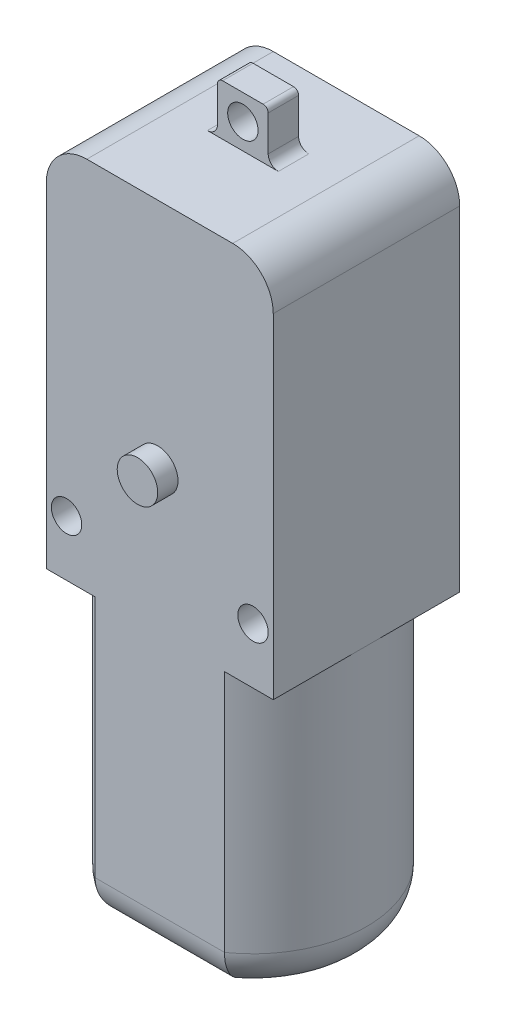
ISO-10303-21;
HEADER;
FILE_DESCRIPTION(('STEP AP214'),'2;1');
FILE_NAME('part.step','',(''),(''),'','','');
FILE_SCHEMA(('AUTOMOTIVE_DESIGN { 1 0 10303 214 1 1 1 1 }'));
ENDSEC;
DATA;
#1=APPLICATION_CONTEXT('core data for automotive mechanical design processes');
#2=APPLICATION_PROTOCOL_DEFINITION('international standard','automotive_design',2000,#1);
#3=PRODUCT_CONTEXT('',#1,'mechanical');
#4=PRODUCT('Part','Part','',(#3));
#5=PRODUCT_RELATED_PRODUCT_CATEGORY('part','',(#4));
#6=PRODUCT_DEFINITION_FORMATION('','',#4);
#7=PRODUCT_DEFINITION_CONTEXT('part definition',#1,'design');
#8=PRODUCT_DEFINITION('design','',#6,#7);
#9=PRODUCT_DEFINITION_SHAPE('','',#8);
#10=(LENGTH_UNIT() NAMED_UNIT(*) SI_UNIT(.MILLI.,.METRE.));
#11=(NAMED_UNIT(*) PLANE_ANGLE_UNIT() SI_UNIT($,.RADIAN.));
#12=(NAMED_UNIT(*) SI_UNIT($,.STERADIAN.) SOLID_ANGLE_UNIT());
#13=UNCERTAINTY_MEASURE_WITH_UNIT(LENGTH_MEASURE(1.E-05),#10,'distance_accuracy_value','');
#14=(GEOMETRIC_REPRESENTATION_CONTEXT(3) GLOBAL_UNCERTAINTY_ASSIGNED_CONTEXT((#13)) GLOBAL_UNIT_ASSIGNED_CONTEXT((#10,
#11,#12)) REPRESENTATION_CONTEXT('',''));
#15=CARTESIAN_POINT('',(0.,0.,0.));
#16=DIRECTION('',(0.,0.,1.));
#17=DIRECTION('',(1.,0.,0.));
#18=AXIS2_PLACEMENT_3D('',#15,#16,#17);
#19=CARTESIAN_POINT('',(4.,37.,18.4));
#20=DIRECTION('',(0.,-1.,0.));
#21=DIRECTION('',(0.,0.,-1.));
#22=AXIS2_PLACEMENT_3D('',#19,#20,#21);
#23=PLANE('',#22);
#24=DIRECTION('',(-1.,0.,0.));
#25=VECTOR('',#24,1.);
#26=CARTESIAN_POINT('',(4.,37.,0.));
#27=LINE('',#26,#25);
#28=CARTESIAN_POINT('',(18.4,37.,0.));
#29=VERTEX_POINT('',#28);
#30=CARTESIAN_POINT('',(4.,37.,0.));
#31=VERTEX_POINT('',#30);
#32=EDGE_CURVE('E382',#29,#31,#27,.T.);
#33=ORIENTED_EDGE('',*,*,#32,.T.);
#34=DIRECTION('',(0.,0.,-1.));
#35=VECTOR('',#34,1.);
#36=CARTESIAN_POINT('',(4.,37.,18.4));
#37=LINE('',#36,#35);
#38=CARTESIAN_POINT('',(4.,37.,18.4));
#39=VERTEX_POINT('',#38);
#40=EDGE_CURVE('E376',#39,#31,#37,.T.);
#41=ORIENTED_EDGE('',*,*,#40,.F.);
#42=DIRECTION('',(-1.,0.,0.));
#43=VECTOR('',#42,1.);
#44=CARTESIAN_POINT('',(4.,37.,18.4));
#45=LINE('',#44,#43);
#46=CARTESIAN_POINT('',(18.4,37.,18.4));
#47=VERTEX_POINT('',#46);
#48=EDGE_CURVE('E399',#47,#39,#45,.T.);
#49=ORIENTED_EDGE('',*,*,#48,.F.);
#50=DIRECTION('',(0.,0.,-1.));
#51=VECTOR('',#50,1.);
#52=CARTESIAN_POINT('',(18.4,37.,18.4));
#53=LINE('',#52,#51);
#54=EDGE_CURVE('E373',#47,#29,#53,.T.);
#55=ORIENTED_EDGE('',*,*,#54,.T.);
#56=EDGE_LOOP('',(#33,#41,#49,#55));
#57=FACE_BOUND('',#56,.T.);
#58=DIRECTION('',(1.,0.,0.));
#59=VECTOR('',#58,1.);
#60=CARTESIAN_POINT('',(8.5,37.,10.));
#61=LINE('',#60,#59);
#62=CARTESIAN_POINT('',(7.5,37.,10.));
#63=VERTEX_POINT('',#62);
#64=CARTESIAN_POINT('',(14.5,37.,10.));
#65=VERTEX_POINT('',#64);
#66=EDGE_CURVE('E553',#63,#65,#61,.T.);
#67=ORIENTED_EDGE('',*,*,#66,.F.);
#68=DIRECTION('',(0.,0.,1.));
#69=VECTOR('',#68,1.);
#70=CARTESIAN_POINT('',(7.5,37.,7.));
#71=LINE('',#70,#69);
#72=CARTESIAN_POINT('',(7.5,37.,7.));
#73=VERTEX_POINT('',#72);
#74=EDGE_CURVE('E594',#63,#73,#71,.F.);
#75=ORIENTED_EDGE('',*,*,#74,.T.);
#76=DIRECTION('',(-1.,0.,0.));
#77=VECTOR('',#76,1.);
#78=CARTESIAN_POINT('',(8.5,37.,7.));
#79=LINE('',#78,#77);
#80=CARTESIAN_POINT('',(14.5,37.,7.));
#81=VERTEX_POINT('',#80);
#82=EDGE_CURVE('E555',#81,#73,#79,.T.);
#83=ORIENTED_EDGE('',*,*,#82,.F.);
#84=DIRECTION('',(0.,0.,-1.));
#85=VECTOR('',#84,1.);
#86=CARTESIAN_POINT('',(14.5,37.,10.));
#87=LINE('',#86,#85);
#88=EDGE_CURVE('E588',#81,#65,#87,.F.);
#89=ORIENTED_EDGE('',*,*,#88,.T.);
#90=EDGE_LOOP('',(#67,#75,#83,#89));
#91=FACE_BOUND('',#90,.T.);
#92=ADVANCED_FACE('F32',(#57,#91),#23,.F.);
#93=CARTESIAN_POINT('',(4.,33.,18.4));
#94=DIRECTION('',(0.,0.,-1.));
#95=DIRECTION('',(-1.,0.,0.));
#96=AXIS2_PLACEMENT_3D('',#93,#94,#95);
#97=PLANE('',#96);
#98=DIRECTION('',(0.,1.,0.));
#99=VECTOR('',#98,1.);
#100=CARTESIAN_POINT('',(4.81251223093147,-28.,18.4));
#101=LINE('',#100,#99);
#102=CARTESIAN_POINT('',(4.81251223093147,-24.,18.4));
#103=VERTEX_POINT('',#102);
#104=CARTESIAN_POINT('',(4.81251223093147,0.,18.4));
#105=VERTEX_POINT('',#104);
#106=EDGE_CURVE('E187',#103,#105,#101,.T.);
#107=ORIENTED_EDGE('',*,*,#106,.F.);
#108=DIRECTION('',(-1.,0.,0.));
#109=VECTOR('',#108,1.);
#110=CARTESIAN_POINT('',(17.5874877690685,-24.,18.4));
#111=LINE('',#110,#109);
#112=CARTESIAN_POINT('',(17.5874877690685,-24.,18.4));
#113=VERTEX_POINT('',#112);
#114=EDGE_CURVE('E183',#103,#113,#111,.F.);
#115=ORIENTED_EDGE('',*,*,#114,.T.);
#116=DIRECTION('',(0.,1.,0.));
#117=VECTOR('',#116,1.);
#118=CARTESIAN_POINT('',(17.5874877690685,-28.,18.4));
#119=LINE('',#118,#117);
#120=CARTESIAN_POINT('',(17.5874877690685,0.,18.4));
#121=VERTEX_POINT('',#120);
#122=EDGE_CURVE('E175',#113,#121,#119,.T.);
#123=ORIENTED_EDGE('',*,*,#122,.T.);
#124=DIRECTION('',(1.,0.,0.));
#125=VECTOR('',#124,1.);
#126=CARTESIAN_POINT('',(0.,0.,18.4));
#127=LINE('',#126,#125);
#128=CARTESIAN_POINT('',(22.4,0.,18.4));
#129=VERTEX_POINT('',#128);
#130=EDGE_CURVE('E180',#121,#129,#127,.T.);
#131=ORIENTED_EDGE('',*,*,#130,.T.);
#132=DIRECTION('',(0.,1.,0.));
#133=VECTOR('',#132,1.);
#134=CARTESIAN_POINT('',(22.4,0.,18.4));
#135=LINE('',#134,#133);
#136=CARTESIAN_POINT('',(22.4,33.,18.4));
#137=VERTEX_POINT('',#136);
#138=EDGE_CURVE('E400',#129,#137,#135,.T.);
#139=ORIENTED_EDGE('',*,*,#138,.T.);
#140=CARTESIAN_POINT('',(18.4,33.,18.4));
#141=DIRECTION('',(0.,0.,1.));
#142=DIRECTION('',(1.,0.,0.));
#143=AXIS2_PLACEMENT_3D('',#140,#141,#142);
#144=CIRCLE('',#143,4.);
#145=EDGE_CURVE('E390',#137,#47,#144,.T.);
#146=ORIENTED_EDGE('',*,*,#145,.T.);
#147=ORIENTED_EDGE('',*,*,#48,.T.);
#148=CARTESIAN_POINT('',(4.,33.,18.4));
#149=DIRECTION('',(0.,0.,1.));
#150=DIRECTION('',(-1.,0.,0.));
#151=AXIS2_PLACEMENT_3D('',#148,#149,#150);
#152=CIRCLE('',#151,4.);
#153=CARTESIAN_POINT('',(0.,33.,18.4));
#154=VERTEX_POINT('',#153);
#155=EDGE_CURVE('E358',#39,#154,#152,.T.);
#156=ORIENTED_EDGE('',*,*,#155,.T.);
#157=DIRECTION('',(0.,-1.,0.));
#158=VECTOR('',#157,1.);
#159=CARTESIAN_POINT('',(0.,0.,18.4));
#160=LINE('',#159,#158);
#161=CARTESIAN_POINT('',(0.,0.,18.4));
#162=VERTEX_POINT('',#161);
#163=EDGE_CURVE('E197',#154,#162,#160,.T.);
#164=ORIENTED_EDGE('',*,*,#163,.T.);
#165=EDGE_CURVE('E196',#162,#105,#127,.T.);
#166=ORIENTED_EDGE('',*,*,#165,.T.);
#167=EDGE_LOOP('',(#107,#115,#123,#131,#139,#146,#147,#156,#164,#166));
#168=FACE_BOUND('',#167,.T.);
#169=CARTESIAN_POINT('',(2.,5.5,18.4));
#170=DIRECTION('',(0.,0.,-1.));
#171=DIRECTION('',(-1.,0.,0.));
#172=AXIS2_PLACEMENT_3D('',#169,#170,#171);
#173=CIRCLE('',#172,1.5);
#174=CARTESIAN_POINT('',(0.500000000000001,5.5,18.4));
#175=VERTEX_POINT('',#174);
#176=EDGE_CURVE('E479',#175,#175,#173,.T.);
#177=ORIENTED_EDGE('',*,*,#176,.T.);
#178=EDGE_LOOP('',(#177));
#179=FACE_BOUND('',#178,.T.);
#180=CARTESIAN_POINT('',(20.4,5.5,18.4));
#181=DIRECTION('',(0.,0.,-1.));
#182=DIRECTION('',(-1.,0.,0.));
#183=AXIS2_PLACEMENT_3D('',#180,#181,#182);
#184=CIRCLE('',#183,1.5);
#185=CARTESIAN_POINT('',(18.9,5.5,18.4));
#186=VERTEX_POINT('',#185);
#187=EDGE_CURVE('E480',#186,#186,#184,.T.);
#188=ORIENTED_EDGE('',*,*,#187,.T.);
#189=EDGE_LOOP('',(#188));
#190=FACE_BOUND('',#189,.T.);
#191=CARTESIAN_POINT('',(11.,14.,18.4));
#192=DIRECTION('',(0.,0.,-1.));
#193=DIRECTION('',(-1.,0.,0.));
#194=AXIS2_PLACEMENT_3D('',#191,#192,#193);
#195=CIRCLE('',#194,2.);
#196=CARTESIAN_POINT('',(9.,14.,18.4));
#197=VERTEX_POINT('',#196);
#198=EDGE_CURVE('E582',#197,#197,#195,.F.);
#199=ORIENTED_EDGE('',*,*,#198,.F.);
#200=EDGE_LOOP('',(#199));
#201=FACE_BOUND('',#200,.T.);
#202=ADVANCED_FACE('F178',(#168,#179,#190,#201),#97,.F.);
#203=CARTESIAN_POINT('',(4.,33.,0.));
#204=DIRECTION('',(0.,0.,-1.));
#205=DIRECTION('',(-1.,0.,0.));
#206=AXIS2_PLACEMENT_3D('',#203,#204,#205);
#207=PLANE('',#206);
#208=CARTESIAN_POINT('',(20.4,5.5,0.));
#209=DIRECTION('',(0.,0.,-1.));
#210=DIRECTION('',(-1.,0.,0.));
#211=AXIS2_PLACEMENT_3D('',#208,#209,#210);
#212=CIRCLE('',#211,1.5);
#213=CARTESIAN_POINT('',(18.9,5.5,0.));
#214=VERTEX_POINT('',#213);
#215=EDGE_CURVE('E474',#214,#214,#212,.T.);
#216=ORIENTED_EDGE('',*,*,#215,.F.);
#217=EDGE_LOOP('',(#216));
#218=FACE_BOUND('',#217,.T.);
#219=CARTESIAN_POINT('',(2.,5.5,0.));
#220=DIRECTION('',(0.,0.,-1.));
#221=DIRECTION('',(-1.,0.,0.));
#222=AXIS2_PLACEMENT_3D('',#219,#220,#221);
#223=CIRCLE('',#222,1.5);
#224=CARTESIAN_POINT('',(0.500000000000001,5.5,0.));
#225=VERTEX_POINT('',#224);
#226=EDGE_CURVE('E477',#225,#225,#223,.T.);
#227=ORIENTED_EDGE('',*,*,#226,.F.);
#228=EDGE_LOOP('',(#227));
#229=FACE_BOUND('',#228,.T.);
#230=DIRECTION('',(0.,1.,0.));
#231=VECTOR('',#230,1.);
#232=CARTESIAN_POINT('',(17.5874877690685,-28.,0.));
#233=LINE('',#232,#231);
#234=CARTESIAN_POINT('',(17.5874877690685,-24.,0.));
#235=VERTEX_POINT('',#234);
#236=CARTESIAN_POINT('',(17.5874877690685,0.,0.));
#237=VERTEX_POINT('',#236);
#238=EDGE_CURVE('E186',#235,#237,#233,.T.);
#239=ORIENTED_EDGE('',*,*,#238,.F.);
#240=DIRECTION('',(1.,0.,0.));
#241=VECTOR('',#240,1.);
#242=CARTESIAN_POINT('',(4.,-24.,0.));
#243=LINE('',#242,#241);
#244=CARTESIAN_POINT('',(4.81251223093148,-24.,0.));
#245=VERTEX_POINT('',#244);
#246=EDGE_CURVE('E236',#235,#245,#243,.F.);
#247=ORIENTED_EDGE('',*,*,#246,.T.);
#248=DIRECTION('',(0.,1.,0.));
#249=VECTOR('',#248,1.);
#250=CARTESIAN_POINT('',(4.81251223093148,-28.,0.));
#251=LINE('',#250,#249);
#252=CARTESIAN_POINT('',(4.81251223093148,0.,0.));
#253=VERTEX_POINT('',#252);
#254=EDGE_CURVE('E233',#245,#253,#251,.T.);
#255=ORIENTED_EDGE('',*,*,#254,.T.);
#256=DIRECTION('',(1.,0.,0.));
#257=VECTOR('',#256,1.);
#258=CARTESIAN_POINT('',(0.,0.,0.));
#259=LINE('',#258,#257);
#260=CARTESIAN_POINT('',(0.,0.,0.));
#261=VERTEX_POINT('',#260);
#262=EDGE_CURVE('E354',#261,#253,#259,.T.);
#263=ORIENTED_EDGE('',*,*,#262,.F.);
#264=DIRECTION('',(0.,-1.,0.));
#265=VECTOR('',#264,1.);
#266=CARTESIAN_POINT('',(0.,0.,0.));
#267=LINE('',#266,#265);
#268=CARTESIAN_POINT('',(0.,33.,0.));
#269=VERTEX_POINT('',#268);
#270=EDGE_CURVE('E238',#269,#261,#267,.T.);
#271=ORIENTED_EDGE('',*,*,#270,.F.);
#272=CARTESIAN_POINT('',(4.,33.,0.));
#273=DIRECTION('',(0.,0.,1.));
#274=DIRECTION('',(-1.,0.,0.));
#275=AXIS2_PLACEMENT_3D('',#272,#273,#274);
#276=CIRCLE('',#275,4.);
#277=EDGE_CURVE('E380',#31,#269,#276,.T.);
#278=ORIENTED_EDGE('',*,*,#277,.F.);
#279=ORIENTED_EDGE('',*,*,#32,.F.);
#280=CARTESIAN_POINT('',(18.4,33.,0.));
#281=DIRECTION('',(0.,0.,1.));
#282=DIRECTION('',(1.,0.,0.));
#283=AXIS2_PLACEMENT_3D('',#280,#281,#282);
#284=CIRCLE('',#283,4.);
#285=CARTESIAN_POINT('',(22.4,33.,0.));
#286=VERTEX_POINT('',#285);
#287=EDGE_CURVE('E383',#286,#29,#284,.T.);
#288=ORIENTED_EDGE('',*,*,#287,.F.);
#289=DIRECTION('',(0.,1.,0.));
#290=VECTOR('',#289,1.);
#291=CARTESIAN_POINT('',(22.4,0.,0.));
#292=LINE('',#291,#290);
#293=CARTESIAN_POINT('',(22.4,0.,0.));
#294=VERTEX_POINT('',#293);
#295=EDGE_CURVE('E362',#294,#286,#292,.T.);
#296=ORIENTED_EDGE('',*,*,#295,.F.);
#297=EDGE_CURVE('E351',#237,#294,#259,.T.);
#298=ORIENTED_EDGE('',*,*,#297,.F.);
#299=EDGE_LOOP('',(#239,#247,#255,#263,#271,#278,#279,#288,#296,#298));
#300=FACE_BOUND('',#299,.T.);
#301=CARTESIAN_POINT('',(11.,26.,0.));
#302=DIRECTION('',(0.,0.,-1.));
#303=DIRECTION('',(-1.,0.,0.));
#304=AXIS2_PLACEMENT_3D('',#301,#302,#303);
#305=CIRCLE('',#304,2.75);
#306=CARTESIAN_POINT('',(8.25,26.,0.));
#307=VERTEX_POINT('',#306);
#308=EDGE_CURVE('E483',#307,#307,#305,.T.);
#309=ORIENTED_EDGE('',*,*,#308,.F.);
#310=EDGE_LOOP('',(#309));
#311=FACE_BOUND('',#310,.T.);
#312=ADVANCED_FACE('F313',(#218,#229,#300,#311),#207,.T.);
#313=CARTESIAN_POINT('',(11.2,-28.,9.2));
#314=DIRECTION('',(0.,-1.,0.));
#315=DIRECTION('',(0.,0.,-1.));
#316=AXIS2_PLACEMENT_3D('',#313,#314,#315);
#317=PLANE('',#316);
#318=CARTESIAN_POINT('',(11.2,-28.,9.2));
#319=DIRECTION('',(0.,-1.,0.));
#320=DIRECTION('',(0.,0.,-1.));
#321=AXIS2_PLACEMENT_3D('',#318,#319,#320);
#322=CIRCLE('',#321,7.2);
#323=CARTESIAN_POINT('',(16.1799598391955,-28.,4.));
#324=VERTEX_POINT('',#323);
#325=CARTESIAN_POINT('',(16.1799598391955,-28.,14.4));
#326=VERTEX_POINT('',#325);
#327=EDGE_CURVE('E419',#324,#326,#322,.T.);
#328=ORIENTED_EDGE('',*,*,#327,.T.);
#329=DIRECTION('',(-1.,0.,0.));
#330=VECTOR('',#329,1.);
#331=CARTESIAN_POINT('',(4.81251223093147,-28.,14.4));
#332=LINE('',#331,#330);
#333=CARTESIAN_POINT('',(6.22004016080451,-28.,14.4));
#334=VERTEX_POINT('',#333);
#335=EDGE_CURVE('E416',#326,#334,#332,.T.);
#336=ORIENTED_EDGE('',*,*,#335,.T.);
#337=CARTESIAN_POINT('',(11.2,-28.,9.2));
#338=DIRECTION('',(0.,-1.,0.));
#339=DIRECTION('',(0.,0.,-1.));
#340=AXIS2_PLACEMENT_3D('',#337,#338,#339);
#341=CIRCLE('',#340,7.2);
#342=CARTESIAN_POINT('',(6.22004016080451,-28.,4.));
#343=VERTEX_POINT('',#342);
#344=EDGE_CURVE('E207',#334,#343,#341,.T.);
#345=ORIENTED_EDGE('',*,*,#344,.T.);
#346=DIRECTION('',(1.,0.,0.));
#347=VECTOR('',#346,1.);
#348=CARTESIAN_POINT('',(11.2,-28.,4.));
#349=LINE('',#348,#347);
#350=EDGE_CURVE('E420',#343,#324,#349,.T.);
#351=ORIENTED_EDGE('',*,*,#350,.T.);
#352=EDGE_LOOP('',(#328,#336,#345,#351));
#353=FACE_BOUND('',#352,.T.);
#354=CARTESIAN_POINT('',(11.2,-28.,9.2));
#355=DIRECTION('',(0.,-1.,0.));
#356=DIRECTION('',(0.,0.,-1.));
#357=AXIS2_PLACEMENT_3D('',#354,#355,#356);
#358=CIRCLE('',#357,1.09574028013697);
#359=CARTESIAN_POINT('',(11.2,-28.,8.10425971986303));
#360=VERTEX_POINT('',#359);
#361=EDGE_CURVE('E251',#360,#360,#358,.T.);
#362=ORIENTED_EDGE('',*,*,#361,.F.);
#363=EDGE_LOOP('',(#362));
#364=FACE_BOUND('',#363,.T.);
#365=ADVANCED_FACE('F332',(#353,#364),#317,.T.);
#366=CARTESIAN_POINT('',(0.,0.,18.4));
#367=DIRECTION('',(0.,1.,0.));
#368=DIRECTION('',(0.,0.,1.));
#369=AXIS2_PLACEMENT_3D('',#366,#367,#368);
#370=PLANE('',#369);
#371=CARTESIAN_POINT('',(11.2,0.,9.2));
#372=DIRECTION('',(0.,-1.,0.));
#373=DIRECTION('',(0.,0.,-1.));
#374=AXIS2_PLACEMENT_3D('',#371,#372,#373);
#375=CIRCLE('',#374,11.2);
#376=CARTESIAN_POINT('',(0.,0.,9.2));
#377=VERTEX_POINT('',#376);
#378=EDGE_CURVE('E224',#105,#377,#375,.T.);
#379=ORIENTED_EDGE('',*,*,#378,.F.);
#380=ORIENTED_EDGE('',*,*,#165,.F.);
#381=DIRECTION('',(0.,0.,-1.));
#382=VECTOR('',#381,1.);
#383=CARTESIAN_POINT('',(0.,0.,18.4));
#384=LINE('',#383,#382);
#385=EDGE_CURVE('E204',#162,#377,#384,.T.);
#386=ORIENTED_EDGE('',*,*,#385,.T.);
#387=EDGE_LOOP('',(#379,#380,#386));
#388=FACE_BOUND('',#387,.T.);
#389=ADVANCED_FACE('F329',(#388),#370,.F.);
#390=EDGE_CURVE('E203',#377,#253,#375,.T.);
#391=ORIENTED_EDGE('',*,*,#390,.F.);
#392=EDGE_CURVE('E210',#377,#261,#384,.T.);
#393=ORIENTED_EDGE('',*,*,#392,.T.);
#394=ORIENTED_EDGE('',*,*,#262,.T.);
#395=EDGE_LOOP('',(#391,#393,#394));
#396=FACE_BOUND('',#395,.T.);
#397=ADVANCED_FACE('F331',(#396),#370,.F.);
#398=CARTESIAN_POINT('',(11.2,0.,9.2));
#399=DIRECTION('',(0.,-1.,0.));
#400=DIRECTION('',(0.,0.,-1.));
#401=AXIS2_PLACEMENT_3D('',#398,#399,#400);
#402=CIRCLE('',#401,11.2);
#403=CARTESIAN_POINT('',(22.4,0.,9.2));
#404=VERTEX_POINT('',#403);
#405=EDGE_CURVE('E202',#237,#404,#402,.T.);
#406=ORIENTED_EDGE('',*,*,#405,.F.);
#407=ORIENTED_EDGE('',*,*,#297,.T.);
#408=DIRECTION('',(0.,0.,-1.));
#409=VECTOR('',#408,1.);
#410=CARTESIAN_POINT('',(22.4,0.,18.4));
#411=LINE('',#410,#409);
#412=EDGE_CURVE('E369',#404,#294,#411,.T.);
#413=ORIENTED_EDGE('',*,*,#412,.F.);
#414=EDGE_LOOP('',(#406,#407,#413));
#415=FACE_BOUND('',#414,.T.);
#416=ADVANCED_FACE('F339',(#415),#370,.F.);
#417=EDGE_CURVE('E191',#404,#121,#402,.T.);
#418=ORIENTED_EDGE('',*,*,#417,.F.);
#419=EDGE_CURVE('E194',#129,#404,#411,.T.);
#420=ORIENTED_EDGE('',*,*,#419,.F.);
#421=ORIENTED_EDGE('',*,*,#130,.F.);
#422=EDGE_LOOP('',(#418,#420,#421));
#423=FACE_BOUND('',#422,.T.);
#424=ADVANCED_FACE('F190',(#423),#370,.F.);
#425=CARTESIAN_POINT('',(0.,0.,18.4));
#426=DIRECTION('',(1.,0.,0.));
#427=DIRECTION('',(0.,0.,-1.));
#428=AXIS2_PLACEMENT_3D('',#425,#426,#427);
#429=PLANE('',#428);
#430=ORIENTED_EDGE('',*,*,#270,.T.);
#431=ORIENTED_EDGE('',*,*,#392,.F.);
#432=ORIENTED_EDGE('',*,*,#385,.F.);
#433=ORIENTED_EDGE('',*,*,#163,.F.);
#434=DIRECTION('',(0.,0.,-1.));
#435=VECTOR('',#434,1.);
#436=CARTESIAN_POINT('',(0.,33.,18.4));
#437=LINE('',#436,#435);
#438=EDGE_CURVE('E347',#154,#269,#437,.T.);
#439=ORIENTED_EDGE('',*,*,#438,.T.);
#440=EDGE_LOOP('',(#430,#431,#432,#433,#439));
#441=FACE_BOUND('',#440,.T.);
#442=ADVANCED_FACE('F327',(#441),#429,.F.);
#443=CARTESIAN_POINT('',(22.4,0.,18.4));
#444=DIRECTION('',(-1.,0.,0.));
#445=DIRECTION('',(0.,0.,1.));
#446=AXIS2_PLACEMENT_3D('',#443,#444,#445);
#447=PLANE('',#446);
#448=ORIENTED_EDGE('',*,*,#295,.T.);
#449=DIRECTION('',(0.,0.,-1.));
#450=VECTOR('',#449,1.);
#451=CARTESIAN_POINT('',(22.4,33.,18.4));
#452=LINE('',#451,#450);
#453=EDGE_CURVE('E370',#137,#286,#452,.T.);
#454=ORIENTED_EDGE('',*,*,#453,.F.);
#455=ORIENTED_EDGE('',*,*,#138,.F.);
#456=ORIENTED_EDGE('',*,*,#419,.T.);
#457=ORIENTED_EDGE('',*,*,#412,.T.);
#458=EDGE_LOOP('',(#448,#454,#455,#456,#457));
#459=FACE_BOUND('',#458,.T.);
#460=ADVANCED_FACE('F323',(#459),#447,.F.);
#461=CARTESIAN_POINT('',(18.4,33.,18.4));
#462=DIRECTION('',(0.,0.,-1.));
#463=DIRECTION('',(-1.,0.,0.));
#464=AXIS2_PLACEMENT_3D('',#461,#462,#463);
#465=CYLINDRICAL_SURFACE('',#464,4.);
#466=ORIENTED_EDGE('',*,*,#287,.T.);
#467=ORIENTED_EDGE('',*,*,#54,.F.);
#468=ORIENTED_EDGE('',*,*,#145,.F.);
#469=ORIENTED_EDGE('',*,*,#453,.T.);
#470=EDGE_LOOP('',(#466,#467,#468,#469));
#471=FACE_BOUND('',#470,.T.);
#472=ADVANCED_FACE('F320',(#471),#465,.T.);
#473=CARTESIAN_POINT('',(4.,33.,18.4));
#474=DIRECTION('',(0.,0.,-1.));
#475=DIRECTION('',(-1.,0.,0.));
#476=AXIS2_PLACEMENT_3D('',#473,#474,#475);
#477=CYLINDRICAL_SURFACE('',#476,4.);
#478=ORIENTED_EDGE('',*,*,#277,.T.);
#479=ORIENTED_EDGE('',*,*,#438,.F.);
#480=ORIENTED_EDGE('',*,*,#155,.F.);
#481=ORIENTED_EDGE('',*,*,#40,.T.);
#482=EDGE_LOOP('',(#478,#479,#480,#481));
#483=FACE_BOUND('',#482,.T.);
#484=ADVANCED_FACE('F318',(#483),#477,.T.);
#485=CARTESIAN_POINT('',(11.2,-28.,9.2));
#486=DIRECTION('',(0.,1.,0.));
#487=DIRECTION('',(0.,0.,1.));
#488=AXIS2_PLACEMENT_3D('',#485,#486,#487);
#489=CYLINDRICAL_SURFACE('',#488,11.2);
#490=ORIENTED_EDGE('',*,*,#254,.F.);
#491=CARTESIAN_POINT('',(11.2,-24.,9.2));
#492=DIRECTION('',(0.,-1.,0.));
#493=DIRECTION('',(0.,0.,-1.));
#494=AXIS2_PLACEMENT_3D('',#491,#492,#493);
#495=CIRCLE('',#494,11.2);
#496=EDGE_CURVE('E240',#245,#103,#495,.F.);
#497=ORIENTED_EDGE('',*,*,#496,.T.);
#498=ORIENTED_EDGE('',*,*,#106,.T.);
#499=ORIENTED_EDGE('',*,*,#378,.T.);
#500=ORIENTED_EDGE('',*,*,#390,.T.);
#501=EDGE_LOOP('',(#490,#497,#498,#499,#500));
#502=FACE_BOUND('',#501,.T.);
#503=ADVANCED_FACE('F433',(#502),#489,.T.);
#504=CARTESIAN_POINT('',(11.2,-28.,9.2));
#505=DIRECTION('',(0.,1.,0.));
#506=DIRECTION('',(0.,0.,1.));
#507=AXIS2_PLACEMENT_3D('',#504,#505,#506);
#508=CYLINDRICAL_SURFACE('',#507,11.2);
#509=ORIENTED_EDGE('',*,*,#122,.F.);
#510=CARTESIAN_POINT('',(11.2,-24.,9.2));
#511=DIRECTION('',(0.,-1.,0.));
#512=DIRECTION('',(0.,0.,-1.));
#513=AXIS2_PLACEMENT_3D('',#510,#511,#512);
#514=CIRCLE('',#513,11.2);
#515=EDGE_CURVE('E234',#113,#235,#514,.F.);
#516=ORIENTED_EDGE('',*,*,#515,.T.);
#517=ORIENTED_EDGE('',*,*,#238,.T.);
#518=ORIENTED_EDGE('',*,*,#405,.T.);
#519=ORIENTED_EDGE('',*,*,#417,.T.);
#520=EDGE_LOOP('',(#509,#516,#517,#518,#519));
#521=FACE_BOUND('',#520,.T.);
#522=ADVANCED_FACE('F200',(#521),#508,.T.);
#523=CARTESIAN_POINT('',(11.2,-24.,4.));
#524=DIRECTION('',(1.,0.,0.));
#525=DIRECTION('',(0.,0.,-1.));
#526=AXIS2_PLACEMENT_3D('',#523,#524,#525);
#527=CYLINDRICAL_SURFACE('',#526,4.);
#528=CARTESIAN_POINT('',(4.81251223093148,-24.,0.));
#529=CARTESIAN_POINT('',(4.81250963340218,-24.1085727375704,-1.44029590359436E-05));
#530=CARTESIAN_POINT('',(4.81389622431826,-24.2171420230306,0.00441992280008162));
#531=CARTESIAN_POINT('',(4.81942860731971,-24.4334792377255,0.0220807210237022));
#532=CARTESIAN_POINT('',(4.82357405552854,-24.5412472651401,0.0353060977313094));
#533=CARTESIAN_POINT('',(4.83459507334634,-24.7550226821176,0.0704121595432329));
#534=CARTESIAN_POINT('',(4.84146572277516,-24.8610328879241,0.092277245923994));
#535=CARTESIAN_POINT('',(4.85789996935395,-25.0707363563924,0.144458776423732));
#536=CARTESIAN_POINT('',(4.86746357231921,-25.1744296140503,0.174775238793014));
#537=CARTESIAN_POINT('',(4.88923523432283,-25.3787721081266,0.243591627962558));
#538=CARTESIAN_POINT('',(4.90144301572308,-25.4794216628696,0.282090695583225));
#539=CARTESIAN_POINT('',(4.92843994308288,-25.6770143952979,0.366929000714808));
#540=CARTESIAN_POINT('',(4.94323004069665,-25.7739561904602,0.413271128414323));
#541=CARTESIAN_POINT('',(4.99136437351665,-26.0581693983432,0.563469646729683));
#542=CARTESIAN_POINT('',(5.02849403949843,-26.2390296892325,0.678566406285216));
#543=CARTESIAN_POINT('',(5.11278396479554,-26.581525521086,0.936900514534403));
#544=CARTESIAN_POINT('',(5.16010223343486,-26.7427871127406,1.08057807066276));
#545=CARTESIAN_POINT('',(5.26353385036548,-27.0389403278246,1.39026034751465));
#546=CARTESIAN_POINT('',(5.31964960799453,-27.1738247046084,1.55627118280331));
#547=CARTESIAN_POINT('',(5.44225656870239,-27.419601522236,1.91307612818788));
#548=CARTESIAN_POINT('',(5.50908818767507,-27.5292254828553,2.10462522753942));
#549=CARTESIAN_POINT('',(5.65008871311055,-27.7148949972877,2.50086177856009));
#550=CARTESIAN_POINT('',(5.72425871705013,-27.7909355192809,2.70555119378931));
#551=CARTESIAN_POINT('',(5.86653414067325,-27.8993021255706,3.089596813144));
#552=CARTESIAN_POINT('',(5.93377106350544,-27.9366082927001,3.26790207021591));
#553=CARTESIAN_POINT('',(6.0717082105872,-27.9866044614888,3.62634029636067));
#554=CARTESIAN_POINT('',(6.14240159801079,-27.9993411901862,3.80646913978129));
#555=CARTESIAN_POINT('',(6.21626231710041,-27.9999917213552,3.99059058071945));
#556=CARTESIAN_POINT('',(6.21815080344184,-28.0000000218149,3.99529555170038));
#557=CARTESIAN_POINT('',(6.22004016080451,-28.,4.));
#558=B_SPLINE_CURVE_WITH_KNOTS('',3,(#528,#529,#530,#531,#532,#533,#534,#535,#536,#537,#538,
#539,#540,#541,#542,#543,#544,#545,#546,#547,#548,#549,#550,#551,#552,#553,#554,#555,#556,#557),
.UNSPECIFIED.,.F.,.F.,(4,2,2,2,2,2,2,2,2,2,2,2,2,2,4),(0.,0.325613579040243,0.651186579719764,
0.976174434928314,1.3011629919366,1.62611744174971,1.95119189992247,2.60070851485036,
3.26113514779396,3.92174296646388,4.61052322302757,5.29940664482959,5.8804390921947,
6.46036541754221,6.4755748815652),.UNSPECIFIED.);
#559=EDGE_CURVE('E268',#245,#343,#558,.T.);
#560=ORIENTED_EDGE('',*,*,#559,.F.);
#561=ORIENTED_EDGE('',*,*,#246,.F.);
#562=CARTESIAN_POINT('',(17.5874877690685,-24.,0.));
#563=CARTESIAN_POINT('',(17.5874903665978,-24.1085727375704,-1.44029590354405E-05));
#564=CARTESIAN_POINT('',(17.5861037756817,-24.2171420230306,0.00441992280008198));
#565=CARTESIAN_POINT('',(17.5805713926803,-24.4334792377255,0.022080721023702));
#566=CARTESIAN_POINT('',(17.5764259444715,-24.5412472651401,0.0353060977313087));
#567=CARTESIAN_POINT('',(17.5654049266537,-24.7550226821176,0.070412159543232));
#568=CARTESIAN_POINT('',(17.5585342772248,-24.8610328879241,0.0922772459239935));
#569=CARTESIAN_POINT('',(17.5421000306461,-25.0707363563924,0.144458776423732));
#570=CARTESIAN_POINT('',(17.5325364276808,-25.1744296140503,0.174775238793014));
#571=CARTESIAN_POINT('',(17.5107647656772,-25.3787721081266,0.243591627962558));
#572=CARTESIAN_POINT('',(17.4985569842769,-25.4794216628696,0.282090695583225));
#573=CARTESIAN_POINT('',(17.4715600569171,-25.6770143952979,0.366929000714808));
#574=CARTESIAN_POINT('',(17.4567699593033,-25.7739561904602,0.413271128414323));
#575=CARTESIAN_POINT('',(17.4086356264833,-26.0581693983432,0.563469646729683));
#576=CARTESIAN_POINT('',(17.3715059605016,-26.2390296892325,0.678566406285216));
#577=CARTESIAN_POINT('',(17.2872160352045,-26.581525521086,0.936900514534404));
#578=CARTESIAN_POINT('',(17.2398977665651,-26.7427871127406,1.08057807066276));
#579=CARTESIAN_POINT('',(17.1364661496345,-27.0389403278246,1.39026034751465));
#580=CARTESIAN_POINT('',(17.0803503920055,-27.1738247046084,1.55627118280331));
#581=CARTESIAN_POINT('',(16.9577434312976,-27.419601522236,1.91307612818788));
#582=CARTESIAN_POINT('',(16.8909118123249,-27.5292254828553,2.10462522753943));
#583=CARTESIAN_POINT('',(16.7499112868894,-27.7148949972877,2.50086177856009));
#584=CARTESIAN_POINT('',(16.6757412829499,-27.7909355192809,2.7055511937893));
#585=CARTESIAN_POINT('',(16.5334658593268,-27.8993021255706,3.089596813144));
#586=CARTESIAN_POINT('',(16.4662289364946,-27.9366082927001,3.26790207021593));
#587=CARTESIAN_POINT('',(16.3282917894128,-27.9866044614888,3.62634029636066));
#588=CARTESIAN_POINT('',(16.2575984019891,-27.9993411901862,3.80646913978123));
#589=CARTESIAN_POINT('',(16.1837376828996,-27.9999917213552,3.99059058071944));
#590=CARTESIAN_POINT('',(16.1818491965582,-28.0000000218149,3.99529555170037));
#591=CARTESIAN_POINT('',(16.1799598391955,-28.,4.));
#592=B_SPLINE_CURVE_WITH_KNOTS('',3,(#562,#563,#564,#565,#566,#567,#568,#569,#570,#571,#572,
#573,#574,#575,#576,#577,#578,#579,#580,#581,#582,#583,#584,#585,#586,#587,#588,#589,#590,#591),
.UNSPECIFIED.,.F.,.F.,(4,2,2,2,2,2,2,2,2,2,2,2,2,2,4),(0.,0.325613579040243,0.651186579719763,
0.976174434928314,1.3011629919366,1.62611744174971,1.95119189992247,2.60070851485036,
3.26113514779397,3.92174296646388,4.61052322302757,5.29940664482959,5.8804390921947,
6.46036541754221,6.4755748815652),.UNSPECIFIED.);
#593=EDGE_CURVE('E274',#324,#235,#592,.F.);
#594=ORIENTED_EDGE('',*,*,#593,.F.);
#595=ORIENTED_EDGE('',*,*,#350,.F.);
#596=EDGE_LOOP('',(#560,#561,#594,#595));
#597=FACE_BOUND('',#596,.T.);
#598=ADVANCED_FACE('F279',(#597),#527,.T.);
#599=CARTESIAN_POINT('',(11.2,-24.,9.2));
#600=DIRECTION('',(0.,-1.,0.));
#601=DIRECTION('',(0.,0.,-1.));
#602=AXIS2_PLACEMENT_3D('',#599,#600,#601);
#603=TOROIDAL_SURFACE('',#602,7.2,4.);
#604=ORIENTED_EDGE('',*,*,#593,.T.);
#605=ORIENTED_EDGE('',*,*,#515,.F.);
#606=CARTESIAN_POINT('',(17.5874877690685,-24.,18.4));
#607=CARTESIAN_POINT('',(17.5874903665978,-24.1085727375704,18.400014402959));
#608=CARTESIAN_POINT('',(17.5861037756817,-24.2171420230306,18.3955800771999));
#609=CARTESIAN_POINT('',(17.5805713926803,-24.4334792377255,18.3779192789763));
#610=CARTESIAN_POINT('',(17.5764259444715,-24.5412472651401,18.3646939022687));
#611=CARTESIAN_POINT('',(17.5654049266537,-24.7550226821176,18.3295878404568));
#612=CARTESIAN_POINT('',(17.5585342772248,-24.8610328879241,18.307722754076));
#613=CARTESIAN_POINT('',(17.5421000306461,-25.0707363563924,18.2555412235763));
#614=CARTESIAN_POINT('',(17.5325364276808,-25.1744296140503,18.225224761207));
#615=CARTESIAN_POINT('',(17.5107647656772,-25.3787721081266,18.1564083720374));
#616=CARTESIAN_POINT('',(17.4985569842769,-25.4794216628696,18.1179093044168));
#617=CARTESIAN_POINT('',(17.4715600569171,-25.6770143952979,18.0330709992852));
#618=CARTESIAN_POINT('',(17.4567699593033,-25.7739561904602,17.9867288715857));
#619=CARTESIAN_POINT('',(17.4086356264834,-26.0581693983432,17.8365303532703));
#620=CARTESIAN_POINT('',(17.3715059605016,-26.2390296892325,17.7214335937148));
#621=CARTESIAN_POINT('',(17.2872160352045,-26.581525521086,17.4630994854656));
#622=CARTESIAN_POINT('',(17.2398977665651,-26.7427871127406,17.3194219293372));
#623=CARTESIAN_POINT('',(17.1364661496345,-27.0389403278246,17.0097396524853));
#624=CARTESIAN_POINT('',(17.0803503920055,-27.1738247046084,16.8437288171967));
#625=CARTESIAN_POINT('',(16.9577434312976,-27.419601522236,16.4869238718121));
#626=CARTESIAN_POINT('',(16.8909118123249,-27.5292254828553,16.2953747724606));
#627=CARTESIAN_POINT('',(16.7499112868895,-27.7148949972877,15.8991382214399));
#628=CARTESIAN_POINT('',(16.6757412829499,-27.7909355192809,15.6944488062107));
#629=CARTESIAN_POINT('',(16.5334658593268,-27.8993021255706,15.310403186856));
#630=CARTESIAN_POINT('',(16.4662289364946,-27.9366082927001,15.1320979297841));
#631=CARTESIAN_POINT('',(16.3282917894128,-27.9866044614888,14.7736597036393));
#632=CARTESIAN_POINT('',(16.2575984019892,-27.9993411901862,14.5935308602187));
#633=CARTESIAN_POINT('',(16.1837376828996,-27.9999917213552,14.4094094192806));
#634=CARTESIAN_POINT('',(16.1818491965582,-28.0000000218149,14.4047044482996));
#635=CARTESIAN_POINT('',(16.1799598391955,-28.,14.4));
#636=B_SPLINE_CURVE_WITH_KNOTS('',3,(#606,#607,#608,#609,#610,#611,#612,#613,#614,#615,#616,
#617,#618,#619,#620,#621,#622,#623,#624,#625,#626,#627,#628,#629,#630,#631,#632,#633,#634,#635),
.UNSPECIFIED.,.F.,.F.,(4,2,2,2,2,2,2,2,2,2,2,2,2,2,4),(0.,0.325613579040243,0.651186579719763,
0.976174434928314,1.3011629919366,1.62611744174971,1.95119189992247,2.60070851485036,
3.26113514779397,3.92174296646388,4.61052322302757,5.29940664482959,5.8804390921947,
6.46036541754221,6.4755748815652),.UNSPECIFIED.);
#637=EDGE_CURVE('E250',#326,#113,#636,.F.);
#638=ORIENTED_EDGE('',*,*,#637,.F.);
#639=ORIENTED_EDGE('',*,*,#327,.F.);
#640=EDGE_LOOP('',(#604,#605,#638,#639));
#641=FACE_BOUND('',#640,.T.);
#642=ADVANCED_FACE('F263',(#641),#603,.T.);
#643=CARTESIAN_POINT('',(11.2,-24.,9.2));
#644=DIRECTION('',(0.,-1.,0.));
#645=DIRECTION('',(0.,0.,-1.));
#646=AXIS2_PLACEMENT_3D('',#643,#644,#645);
#647=TOROIDAL_SURFACE('',#646,7.2,4.);
#648=ORIENTED_EDGE('',*,*,#559,.T.);
#649=ORIENTED_EDGE('',*,*,#344,.F.);
#650=CARTESIAN_POINT('',(4.81251223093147,-24.,18.4));
#651=CARTESIAN_POINT('',(4.81250963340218,-24.1085727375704,18.400014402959));
#652=CARTESIAN_POINT('',(4.81389622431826,-24.2171420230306,18.3955800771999));
#653=CARTESIAN_POINT('',(4.81942860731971,-24.4334792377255,18.3779192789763));
#654=CARTESIAN_POINT('',(4.82357405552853,-24.5412472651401,18.3646939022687));
#655=CARTESIAN_POINT('',(4.83459507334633,-24.7550226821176,18.3295878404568));
#656=CARTESIAN_POINT('',(4.84146572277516,-24.8610328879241,18.307722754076));
#657=CARTESIAN_POINT('',(4.85789996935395,-25.0707363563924,18.2555412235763));
#658=CARTESIAN_POINT('',(4.8674635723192,-25.1744296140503,18.225224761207));
#659=CARTESIAN_POINT('',(4.88923523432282,-25.3787721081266,18.1564083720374));
#660=CARTESIAN_POINT('',(4.90144301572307,-25.4794216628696,18.1179093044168));
#661=CARTESIAN_POINT('',(4.92843994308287,-25.6770143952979,18.0330709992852));
#662=CARTESIAN_POINT('',(4.94323004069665,-25.7739561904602,17.9867288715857));
#663=CARTESIAN_POINT('',(4.99136437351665,-26.0581693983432,17.8365303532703));
#664=CARTESIAN_POINT('',(5.02849403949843,-26.2390296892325,17.7214335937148));
#665=CARTESIAN_POINT('',(5.11278396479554,-26.581525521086,17.4630994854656));
#666=CARTESIAN_POINT('',(5.16010223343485,-26.7427871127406,17.3194219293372));
#667=CARTESIAN_POINT('',(5.26353385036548,-27.0389403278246,17.0097396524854));
#668=CARTESIAN_POINT('',(5.31964960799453,-27.1738247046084,16.8437288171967));
#669=CARTESIAN_POINT('',(5.44225656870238,-27.419601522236,16.4869238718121));
#670=CARTESIAN_POINT('',(5.50908818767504,-27.5292254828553,16.2953747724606));
#671=CARTESIAN_POINT('',(5.65008871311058,-27.7148949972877,15.8991382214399));
#672=CARTESIAN_POINT('',(5.72425871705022,-27.7909355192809,15.6944488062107));
#673=CARTESIAN_POINT('',(5.86653414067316,-27.8993021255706,15.310403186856));
#674=CARTESIAN_POINT('',(5.93377106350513,-27.9366082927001,15.132097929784));
#675=CARTESIAN_POINT('',(6.07170821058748,-27.9866044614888,14.7736597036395));
#676=CARTESIAN_POINT('',(6.14240159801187,-27.9993411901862,14.5935308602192));
#677=CARTESIAN_POINT('',(6.21626231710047,-27.9999917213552,14.4094094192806));
#678=CARTESIAN_POINT('',(6.21815080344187,-28.0000000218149,14.4047044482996));
#679=CARTESIAN_POINT('',(6.22004016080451,-28.,14.4));
#680=B_SPLINE_CURVE_WITH_KNOTS('',3,(#650,#651,#652,#653,#654,#655,#656,#657,#658,#659,#660,
#661,#662,#663,#664,#665,#666,#667,#668,#669,#670,#671,#672,#673,#674,#675,#676,#677,#678,#679),
.UNSPECIFIED.,.F.,.F.,(4,2,2,2,2,2,2,2,2,2,2,2,2,2,4),(0.,0.325613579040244,0.651186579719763,
0.976174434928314,1.3011629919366,1.62611744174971,1.95119189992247,2.60070851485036,
3.26113514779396,3.92174296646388,4.61052322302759,5.29940664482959,5.88043909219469,
6.46036541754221,6.4755748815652),.UNSPECIFIED.);
#681=EDGE_CURVE('E243',#103,#334,#680,.T.);
#682=ORIENTED_EDGE('',*,*,#681,.F.);
#683=ORIENTED_EDGE('',*,*,#496,.F.);
#684=EDGE_LOOP('',(#648,#649,#682,#683));
#685=FACE_BOUND('',#684,.T.);
#686=ADVANCED_FACE('F260',(#685),#647,.T.);
#687=CARTESIAN_POINT('',(11.2,-24.,14.4));
#688=DIRECTION('',(1.,0.,0.));
#689=DIRECTION('',(0.,0.,-1.));
#690=AXIS2_PLACEMENT_3D('',#687,#688,#689);
#691=CYLINDRICAL_SURFACE('',#690,4.);
#692=ORIENTED_EDGE('',*,*,#637,.T.);
#693=ORIENTED_EDGE('',*,*,#114,.F.);
#694=ORIENTED_EDGE('',*,*,#681,.T.);
#695=ORIENTED_EDGE('',*,*,#335,.F.);
#696=EDGE_LOOP('',(#692,#693,#694,#695));
#697=FACE_BOUND('',#696,.T.);
#698=ADVANCED_FACE('F257',(#697),#691,.T.);
#699=CARTESIAN_POINT('',(11.2,-30.,9.2));
#700=DIRECTION('',(0.,1.,0.));
#701=DIRECTION('',(0.,0.,1.));
#702=AXIS2_PLACEMENT_3D('',#699,#700,#701);
#703=CYLINDRICAL_SURFACE('',#702,1.09574028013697);
#704=CARTESIAN_POINT('',(11.2,-29.8,9.2));
#705=DIRECTION('',(0.,-1.,0.));
#706=DIRECTION('',(0.,0.,-1.));
#707=AXIS2_PLACEMENT_3D('',#704,#705,#706);
#708=CIRCLE('',#707,1.09574028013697);
#709=CARTESIAN_POINT('',(11.2,-29.8,8.10425971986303));
#710=VERTEX_POINT('',#709);
#711=EDGE_CURVE('E585',#710,#710,#708,.F.);
#712=ORIENTED_EDGE('',*,*,#711,.T.);
#713=EDGE_LOOP('',(#712));
#714=FACE_BOUND('',#713,.T.);
#715=ORIENTED_EDGE('',*,*,#361,.T.);
#716=EDGE_LOOP('',(#715));
#717=FACE_BOUND('',#716,.T.);
#718=ADVANCED_FACE('F447',(#714,#717),#703,.T.);
#719=CARTESIAN_POINT('',(11.2,-30.,9.2));
#720=DIRECTION('',(0.,-1.,0.));
#721=DIRECTION('',(0.,0.,-1.));
#722=AXIS2_PLACEMENT_3D('',#719,#720,#721);
#723=PLANE('',#722);
#724=CARTESIAN_POINT('',(11.2,-30.,9.2));
#725=DIRECTION('',(0.,-1.,0.));
#726=DIRECTION('',(0.,0.,-1.));
#727=AXIS2_PLACEMENT_3D('',#724,#725,#726);
#728=CIRCLE('',#727,0.895740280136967);
#729=CARTESIAN_POINT('',(11.2,-30.,8.30425971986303));
#730=VERTEX_POINT('',#729);
#731=EDGE_CURVE('E242',#730,#730,#728,.T.);
#732=ORIENTED_EDGE('',*,*,#731,.T.);
#733=EDGE_LOOP('',(#732));
#734=FACE_BOUND('',#733,.T.);
#735=ADVANCED_FACE('F289',(#734),#723,.T.);
#736=CARTESIAN_POINT('',(11.2,-29.8,9.2));
#737=DIRECTION('',(0.,-1.,0.));
#738=DIRECTION('',(0.,0.,-1.));
#739=AXIS2_PLACEMENT_3D('',#736,#737,#738);
#740=TOROIDAL_SURFACE('',#739,0.895740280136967,0.2);
#741=ORIENTED_EDGE('',*,*,#711,.F.);
#742=EDGE_LOOP('',(#741));
#743=FACE_BOUND('',#742,.T.);
#744=ORIENTED_EDGE('',*,*,#731,.F.);
#745=EDGE_LOOP('',(#744));
#746=FACE_BOUND('',#745,.T.);
#747=ADVANCED_FACE('F284',(#743,#746),#740,.T.);
#748=CARTESIAN_POINT('',(11.,26.,-2.));
#749=DIRECTION('',(0.,0.,1.));
#750=DIRECTION('',(1.,0.,0.));
#751=AXIS2_PLACEMENT_3D('',#748,#749,#750);
#752=CYLINDRICAL_SURFACE('',#751,2.75);
#753=CARTESIAN_POINT('',(11.,26.,-2.));
#754=DIRECTION('',(0.,0.,-1.));
#755=DIRECTION('',(-1.,0.,0.));
#756=AXIS2_PLACEMENT_3D('',#753,#754,#755);
#757=CIRCLE('',#756,2.75);
#758=CARTESIAN_POINT('',(8.25,26.,-2.));
#759=VERTEX_POINT('',#758);
#760=EDGE_CURVE('E490',#759,#759,#757,.T.);
#761=ORIENTED_EDGE('',*,*,#760,.F.);
#762=EDGE_LOOP('',(#761));
#763=FACE_BOUND('',#762,.T.);
#764=ORIENTED_EDGE('',*,*,#308,.T.);
#765=EDGE_LOOP('',(#764));
#766=FACE_BOUND('',#765,.T.);
#767=ADVANCED_FACE('F288',(#763,#766),#752,.T.);
#768=CARTESIAN_POINT('',(11.,26.,-2.));
#769=DIRECTION('',(0.,0.,-1.));
#770=DIRECTION('',(-1.,0.,0.));
#771=AXIS2_PLACEMENT_3D('',#768,#769,#770);
#772=PLANE('',#771);
#773=ORIENTED_EDGE('',*,*,#760,.T.);
#774=EDGE_LOOP('',(#773));
#775=FACE_BOUND('',#774,.T.);
#776=ADVANCED_FACE('F499',(#775),#772,.T.);
#777=CARTESIAN_POINT('',(2.,5.5,2000.));
#778=DIRECTION('',(0.,0.,-1.));
#779=DIRECTION('',(-1.,0.,0.));
#780=AXIS2_PLACEMENT_3D('',#777,#778,#779);
#781=CYLINDRICAL_SURFACE('',#780,1.5);
#782=ORIENTED_EDGE('',*,*,#226,.T.);
#783=EDGE_LOOP('',(#782));
#784=FACE_BOUND('',#783,.T.);
#785=ORIENTED_EDGE('',*,*,#176,.F.);
#786=EDGE_LOOP('',(#785));
#787=FACE_BOUND('',#786,.T.);
#788=ADVANCED_FACE('F504',(#784,#787),#781,.F.);
#789=CARTESIAN_POINT('',(20.4,5.5,2000.));
#790=DIRECTION('',(0.,0.,-1.));
#791=DIRECTION('',(-1.,0.,0.));
#792=AXIS2_PLACEMENT_3D('',#789,#790,#791);
#793=CYLINDRICAL_SURFACE('',#792,1.5);
#794=ORIENTED_EDGE('',*,*,#215,.T.);
#795=EDGE_LOOP('',(#794));
#796=FACE_BOUND('',#795,.T.);
#797=ORIENTED_EDGE('',*,*,#187,.F.);
#798=EDGE_LOOP('',(#797));
#799=FACE_BOUND('',#798,.T.);
#800=ADVANCED_FACE('F511',(#796,#799),#793,.F.);
#801=CARTESIAN_POINT('',(11.,14.,20.4));
#802=DIRECTION('',(0.,0.,-1.));
#803=DIRECTION('',(-1.,0.,0.));
#804=AXIS2_PLACEMENT_3D('',#801,#802,#803);
#805=CYLINDRICAL_SURFACE('',#804,2.);
#806=CARTESIAN_POINT('',(11.,14.,20.4));
#807=DIRECTION('',(0.,0.,1.));
#808=DIRECTION('',(1.,0.,0.));
#809=AXIS2_PLACEMENT_3D('',#806,#807,#808);
#810=CIRCLE('',#809,2.);
#811=CARTESIAN_POINT('',(13.,14.,20.4));
#812=VERTEX_POINT('',#811);
#813=EDGE_CURVE('E573',#812,#812,#810,.T.);
#814=ORIENTED_EDGE('',*,*,#813,.F.);
#815=EDGE_LOOP('',(#814));
#816=FACE_BOUND('',#815,.T.);
#817=ORIENTED_EDGE('',*,*,#198,.T.);
#818=EDGE_LOOP('',(#817));
#819=FACE_BOUND('',#818,.T.);
#820=ADVANCED_FACE('F514',(#816,#819),#805,.T.);
#821=CARTESIAN_POINT('',(11.,14.,20.4));
#822=DIRECTION('',(0.,0.,1.));
#823=DIRECTION('',(1.,0.,0.));
#824=AXIS2_PLACEMENT_3D('',#821,#822,#823);
#825=PLANE('',#824);
#826=ORIENTED_EDGE('',*,*,#813,.T.);
#827=EDGE_LOOP('',(#826));
#828=FACE_BOUND('',#827,.T.);
#829=ADVANCED_FACE('F518',(#828),#825,.T.);
#830=CARTESIAN_POINT('',(8.5,42.,7.));
#831=DIRECTION('',(1.,0.,0.));
#832=DIRECTION('',(0.,0.,-1.));
#833=AXIS2_PLACEMENT_3D('',#830,#831,#832);
#834=PLANE('',#833);
#835=DIRECTION('',(0.,-1.,0.));
#836=VECTOR('',#835,1.);
#837=CARTESIAN_POINT('',(8.5,42.,10.));
#838=LINE('',#837,#836);
#839=CARTESIAN_POINT('',(8.5,41.5,10.));
#840=VERTEX_POINT('',#839);
#841=CARTESIAN_POINT('',(8.5,38.,10.));
#842=VERTEX_POINT('',#841);
#843=EDGE_CURVE('E572',#840,#842,#838,.T.);
#844=ORIENTED_EDGE('',*,*,#843,.F.);
#845=DIRECTION('',(0.,0.,1.));
#846=VECTOR('',#845,1.);
#847=CARTESIAN_POINT('',(8.5,41.5,7.));
#848=LINE('',#847,#846);
#849=CARTESIAN_POINT('',(8.5,41.5,7.));
#850=VERTEX_POINT('',#849);
#851=EDGE_CURVE('E11',#840,#850,#848,.F.);
#852=ORIENTED_EDGE('',*,*,#851,.T.);
#853=DIRECTION('',(0.,-1.,0.));
#854=VECTOR('',#853,1.);
#855=CARTESIAN_POINT('',(8.5,42.,7.));
#856=LINE('',#855,#854);
#857=CARTESIAN_POINT('',(8.5,38.,7.));
#858=VERTEX_POINT('',#857);
#859=EDGE_CURVE('E564',#850,#858,#856,.T.);
#860=ORIENTED_EDGE('',*,*,#859,.T.);
#861=DIRECTION('',(0.,0.,1.));
#862=VECTOR('',#861,1.);
#863=CARTESIAN_POINT('',(8.5,38.,10.));
#864=LINE('',#863,#862);
#865=EDGE_CURVE('E584',#858,#842,#864,.T.);
#866=ORIENTED_EDGE('',*,*,#865,.T.);
#867=EDGE_LOOP('',(#844,#852,#860,#866));
#868=FACE_BOUND('',#867,.T.);
#869=ADVANCED_FACE('F522',(#868),#834,.F.);
#870=CARTESIAN_POINT('',(8.5,42.,10.));
#871=DIRECTION('',(0.,0.,-1.));
#872=DIRECTION('',(-1.,0.,0.));
#873=AXIS2_PLACEMENT_3D('',#870,#871,#872);
#874=PLANE('',#873);
#875=CARTESIAN_POINT('',(11.,39.5,10.));
#876=DIRECTION('',(0.,0.,-1.));
#877=DIRECTION('',(-1.,0.,0.));
#878=AXIS2_PLACEMENT_3D('',#875,#876,#877);
#879=CIRCLE('',#878,1.5);
#880=CARTESIAN_POINT('',(9.5,39.5,10.));
#881=VERTEX_POINT('',#880);
#882=EDGE_CURVE('E552',#881,#881,#879,.T.);
#883=ORIENTED_EDGE('',*,*,#882,.T.);
#884=EDGE_LOOP('',(#883));
#885=FACE_BOUND('',#884,.T.);
#886=DIRECTION('',(0.,-1.,0.));
#887=VECTOR('',#886,1.);
#888=CARTESIAN_POINT('',(13.5,42.,10.));
#889=LINE('',#888,#887);
#890=CARTESIAN_POINT('',(13.5,41.5,10.));
#891=VERTEX_POINT('',#890);
#892=CARTESIAN_POINT('',(13.5,38.,10.));
#893=VERTEX_POINT('',#892);
#894=EDGE_CURVE('E570',#891,#893,#889,.T.);
#895=ORIENTED_EDGE('',*,*,#894,.F.);
#896=CARTESIAN_POINT('',(13.,41.5,10.));
#897=DIRECTION('',(0.,0.,-1.));
#898=DIRECTION('',(-1.,0.,0.));
#899=AXIS2_PLACEMENT_3D('',#896,#897,#898);
#900=CIRCLE('',#899,0.5);
#901=CARTESIAN_POINT('',(13.,42.,10.));
#902=VERTEX_POINT('',#901);
#903=EDGE_CURVE('E40',#891,#902,#900,.F.);
#904=ORIENTED_EDGE('',*,*,#903,.T.);
#905=DIRECTION('',(1.,0.,0.));
#906=VECTOR('',#905,1.);
#907=CARTESIAN_POINT('',(8.5,42.,10.));
#908=LINE('',#907,#906);
#909=CARTESIAN_POINT('',(9.,42.,10.));
#910=VERTEX_POINT('',#909);
#911=EDGE_CURVE('E559',#910,#902,#908,.T.);
#912=ORIENTED_EDGE('',*,*,#911,.F.);
#913=CARTESIAN_POINT('',(9.,41.5,10.));
#914=DIRECTION('',(0.,0.,-1.));
#915=DIRECTION('',(-1.,0.,0.));
#916=AXIS2_PLACEMENT_3D('',#913,#914,#915);
#917=CIRCLE('',#916,0.5);
#918=EDGE_CURVE('E47',#910,#840,#917,.F.);
#919=ORIENTED_EDGE('',*,*,#918,.T.);
#920=ORIENTED_EDGE('',*,*,#843,.T.);
#921=CARTESIAN_POINT('',(7.5,38.,10.));
#922=DIRECTION('',(0.,0.,-1.));
#923=DIRECTION('',(-1.,0.,0.));
#924=AXIS2_PLACEMENT_3D('',#921,#922,#923);
#925=CIRCLE('',#924,1.);
#926=EDGE_CURVE('E600',#842,#63,#925,.T.);
#927=ORIENTED_EDGE('',*,*,#926,.T.);
#928=ORIENTED_EDGE('',*,*,#66,.T.);
#929=CARTESIAN_POINT('',(14.5,38.,10.));
#930=DIRECTION('',(0.,0.,-1.));
#931=DIRECTION('',(-1.,0.,0.));
#932=AXIS2_PLACEMENT_3D('',#929,#930,#931);
#933=CIRCLE('',#932,1.);
#934=EDGE_CURVE('E609',#65,#893,#933,.T.);
#935=ORIENTED_EDGE('',*,*,#934,.T.);
#936=EDGE_LOOP('',(#895,#904,#912,#919,#920,#927,#928,#935));
#937=FACE_BOUND('',#936,.T.);
#938=ADVANCED_FACE('F526',(#885,#937),#874,.F.);
#939=CARTESIAN_POINT('',(13.5,42.,7.));
#940=DIRECTION('',(-1.,0.,0.));
#941=DIRECTION('',(0.,0.,1.));
#942=AXIS2_PLACEMENT_3D('',#939,#940,#941);
#943=PLANE('',#942);
#944=DIRECTION('',(0.,-1.,0.));
#945=VECTOR('',#944,1.);
#946=CARTESIAN_POINT('',(13.5,42.,7.));
#947=LINE('',#946,#945);
#948=CARTESIAN_POINT('',(13.5,41.5,7.));
#949=VERTEX_POINT('',#948);
#950=CARTESIAN_POINT('',(13.5,38.,7.));
#951=VERTEX_POINT('',#950);
#952=EDGE_CURVE('E568',#949,#951,#947,.T.);
#953=ORIENTED_EDGE('',*,*,#952,.F.);
#954=DIRECTION('',(0.,0.,-1.));
#955=VECTOR('',#954,1.);
#956=CARTESIAN_POINT('',(13.5,41.5,10.));
#957=LINE('',#956,#955);
#958=EDGE_CURVE('E55',#949,#891,#957,.F.);
#959=ORIENTED_EDGE('',*,*,#958,.T.);
#960=ORIENTED_EDGE('',*,*,#894,.T.);
#961=DIRECTION('',(0.,0.,-1.));
#962=VECTOR('',#961,1.);
#963=CARTESIAN_POINT('',(13.5,38.,7.));
#964=LINE('',#963,#962);
#965=EDGE_CURVE('E597',#893,#951,#964,.T.);
#966=ORIENTED_EDGE('',*,*,#965,.T.);
#967=EDGE_LOOP('',(#953,#959,#960,#966));
#968=FACE_BOUND('',#967,.T.);
#969=ADVANCED_FACE('F530',(#968),#943,.F.);
#970=CARTESIAN_POINT('',(8.5,42.,7.));
#971=DIRECTION('',(0.,0.,1.));
#972=DIRECTION('',(1.,0.,0.));
#973=AXIS2_PLACEMENT_3D('',#970,#971,#972);
#974=PLANE('',#973);
#975=CARTESIAN_POINT('',(11.,39.5,7.));
#976=DIRECTION('',(0.,0.,-1.));
#977=DIRECTION('',(-1.,0.,0.));
#978=AXIS2_PLACEMENT_3D('',#975,#976,#977);
#979=CIRCLE('',#978,1.5);
#980=CARTESIAN_POINT('',(9.5,39.5,7.));
#981=VERTEX_POINT('',#980);
#982=EDGE_CURVE('E549',#981,#981,#979,.T.);
#983=ORIENTED_EDGE('',*,*,#982,.F.);
#984=EDGE_LOOP('',(#983));
#985=FACE_BOUND('',#984,.T.);
#986=DIRECTION('',(-1.,0.,0.));
#987=VECTOR('',#986,1.);
#988=CARTESIAN_POINT('',(8.5,42.,7.));
#989=LINE('',#988,#987);
#990=CARTESIAN_POINT('',(13.,42.,7.));
#991=VERTEX_POINT('',#990);
#992=CARTESIAN_POINT('',(9.,42.,7.));
#993=VERTEX_POINT('',#992);
#994=EDGE_CURVE('E562',#991,#993,#989,.T.);
#995=ORIENTED_EDGE('',*,*,#994,.F.);
#996=CARTESIAN_POINT('',(13.,41.5,7.));
#997=DIRECTION('',(0.,0.,1.));
#998=DIRECTION('',(1.,0.,0.));
#999=AXIS2_PLACEMENT_3D('',#996,#997,#998);
#1000=CIRCLE('',#999,0.5);
#1001=EDGE_CURVE('E620',#991,#949,#1000,.F.);
#1002=ORIENTED_EDGE('',*,*,#1001,.T.);
#1003=ORIENTED_EDGE('',*,*,#952,.T.);
#1004=CARTESIAN_POINT('',(14.5,38.,7.));
#1005=DIRECTION('',(0.,0.,1.));
#1006=DIRECTION('',(1.,0.,0.));
#1007=AXIS2_PLACEMENT_3D('',#1004,#1005,#1006);
#1008=CIRCLE('',#1007,1.);
#1009=EDGE_CURVE('E606',#951,#81,#1008,.T.);
#1010=ORIENTED_EDGE('',*,*,#1009,.T.);
#1011=ORIENTED_EDGE('',*,*,#82,.T.);
#1012=CARTESIAN_POINT('',(7.5,38.,7.));
#1013=DIRECTION('',(0.,0.,1.));
#1014=DIRECTION('',(1.,0.,0.));
#1015=AXIS2_PLACEMENT_3D('',#1012,#1013,#1014);
#1016=CIRCLE('',#1015,1.);
#1017=EDGE_CURVE('E603',#73,#858,#1016,.T.);
#1018=ORIENTED_EDGE('',*,*,#1017,.T.);
#1019=ORIENTED_EDGE('',*,*,#859,.F.);
#1020=CARTESIAN_POINT('',(9.,41.5,7.));
#1021=DIRECTION('',(0.,0.,1.));
#1022=DIRECTION('',(1.,0.,0.));
#1023=AXIS2_PLACEMENT_3D('',#1020,#1021,#1022);
#1024=CIRCLE('',#1023,0.5);
#1025=EDGE_CURVE('E618',#850,#993,#1024,.F.);
#1026=ORIENTED_EDGE('',*,*,#1025,.T.);
#1027=EDGE_LOOP('',(#995,#1002,#1003,#1010,#1011,#1018,#1019,#1026));
#1028=FACE_BOUND('',#1027,.T.);
#1029=ADVANCED_FACE('F534',(#985,#1028),#974,.F.);
#1030=CARTESIAN_POINT('',(0.,42.,0.));
#1031=DIRECTION('',(0.,1.,0.));
#1032=DIRECTION('',(0.,0.,1.));
#1033=AXIS2_PLACEMENT_3D('',#1030,#1031,#1032);
#1034=PLANE('',#1033);
#1035=ORIENTED_EDGE('',*,*,#911,.T.);
#1036=DIRECTION('',(0.,0.,-1.));
#1037=VECTOR('',#1036,1.);
#1038=CARTESIAN_POINT('',(13.,42.,7.));
#1039=LINE('',#1038,#1037);
#1040=EDGE_CURVE('E615',#902,#991,#1039,.T.);
#1041=ORIENTED_EDGE('',*,*,#1040,.T.);
#1042=ORIENTED_EDGE('',*,*,#994,.T.);
#1043=DIRECTION('',(0.,0.,1.));
#1044=VECTOR('',#1043,1.);
#1045=CARTESIAN_POINT('',(9.,42.,10.));
#1046=LINE('',#1045,#1044);
#1047=EDGE_CURVE('E612',#993,#910,#1046,.T.);
#1048=ORIENTED_EDGE('',*,*,#1047,.T.);
#1049=EDGE_LOOP('',(#1035,#1041,#1042,#1048));
#1050=FACE_BOUND('',#1049,.T.);
#1051=ADVANCED_FACE('F537',(#1050),#1034,.T.);
#1052=CARTESIAN_POINT('',(11.,39.5,12.));
#1053=DIRECTION('',(0.,0.,-1.));
#1054=DIRECTION('',(-1.,0.,0.));
#1055=AXIS2_PLACEMENT_3D('',#1052,#1053,#1054);
#1056=CYLINDRICAL_SURFACE('',#1055,1.5);
#1057=ORIENTED_EDGE('',*,*,#982,.T.);
#1058=EDGE_LOOP('',(#1057));
#1059=FACE_BOUND('',#1058,.T.);
#1060=ORIENTED_EDGE('',*,*,#882,.F.);
#1061=EDGE_LOOP('',(#1060));
#1062=FACE_BOUND('',#1061,.T.);
#1063=ADVANCED_FACE('F295',(#1059,#1062),#1056,.F.);
#1064=CARTESIAN_POINT('',(7.5,38.,7.));
#1065=DIRECTION('',(0.,0.,-1.));
#1066=DIRECTION('',(-1.,0.,0.));
#1067=AXIS2_PLACEMENT_3D('',#1064,#1065,#1066);
#1068=CYLINDRICAL_SURFACE('',#1067,1.);
#1069=ORIENTED_EDGE('',*,*,#1017,.F.);
#1070=ORIENTED_EDGE('',*,*,#74,.F.);
#1071=ORIENTED_EDGE('',*,*,#926,.F.);
#1072=ORIENTED_EDGE('',*,*,#865,.F.);
#1073=EDGE_LOOP('',(#1069,#1070,#1071,#1072));
#1074=FACE_BOUND('',#1073,.T.);
#1075=ADVANCED_FACE('F291',(#1074),#1068,.F.);
#1076=CARTESIAN_POINT('',(14.5,38.,7.));
#1077=DIRECTION('',(0.,0.,1.));
#1078=DIRECTION('',(1.,0.,0.));
#1079=AXIS2_PLACEMENT_3D('',#1076,#1077,#1078);
#1080=CYLINDRICAL_SURFACE('',#1079,1.);
#1081=ORIENTED_EDGE('',*,*,#934,.F.);
#1082=ORIENTED_EDGE('',*,*,#88,.F.);
#1083=ORIENTED_EDGE('',*,*,#1009,.F.);
#1084=ORIENTED_EDGE('',*,*,#965,.F.);
#1085=EDGE_LOOP('',(#1081,#1082,#1083,#1084));
#1086=FACE_BOUND('',#1085,.T.);
#1087=ADVANCED_FACE('F294',(#1086),#1080,.F.);
#1088=CARTESIAN_POINT('',(13.,41.5,0.));
#1089=DIRECTION('',(0.,0.,1.));
#1090=DIRECTION('',(1.,0.,0.));
#1091=AXIS2_PLACEMENT_3D('',#1088,#1089,#1090);
#1092=CYLINDRICAL_SURFACE('',#1091,0.5);
#1093=ORIENTED_EDGE('',*,*,#903,.F.);
#1094=ORIENTED_EDGE('',*,*,#958,.F.);
#1095=ORIENTED_EDGE('',*,*,#1001,.F.);
#1096=ORIENTED_EDGE('',*,*,#1040,.F.);
#1097=EDGE_LOOP('',(#1093,#1094,#1095,#1096));
#1098=FACE_BOUND('',#1097,.T.);
#1099=ADVANCED_FACE('F298',(#1098),#1092,.T.);
#1100=CARTESIAN_POINT('',(9.00000000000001,41.5,0.));
#1101=DIRECTION('',(0.,0.,-1.));
#1102=DIRECTION('',(-1.,0.,0.));
#1103=AXIS2_PLACEMENT_3D('',#1100,#1101,#1102);
#1104=CYLINDRICAL_SURFACE('',#1103,0.5);
#1105=ORIENTED_EDGE('',*,*,#1025,.F.);
#1106=ORIENTED_EDGE('',*,*,#851,.F.);
#1107=ORIENTED_EDGE('',*,*,#918,.F.);
#1108=ORIENTED_EDGE('',*,*,#1047,.F.);
#1109=EDGE_LOOP('',(#1105,#1106,#1107,#1108));
#1110=FACE_BOUND('',#1109,.T.);
#1111=ADVANCED_FACE('F34',(#1110),#1104,.T.);
#1112=CLOSED_SHELL('',(#92,#202,#312,#365,#389,#397,#416,#424,#442,#460,#472,#484,#503,#522,
#598,#642,#686,#698,#718,#735,#747,#767,#776,#788,#800,#820,#829,#869,#938,#969,#1029,#1051,
#1063,#1075,#1087,#1099,#1111));
#1113=MANIFOLD_SOLID_BREP('B2',#1112);
#1114=ADVANCED_BREP_SHAPE_REPRESENTATION('',(#18,#1113),#14);
#1115=SHAPE_DEFINITION_REPRESENTATION(#9,#1114);
ENDSEC;
END-ISO-10303-21;
